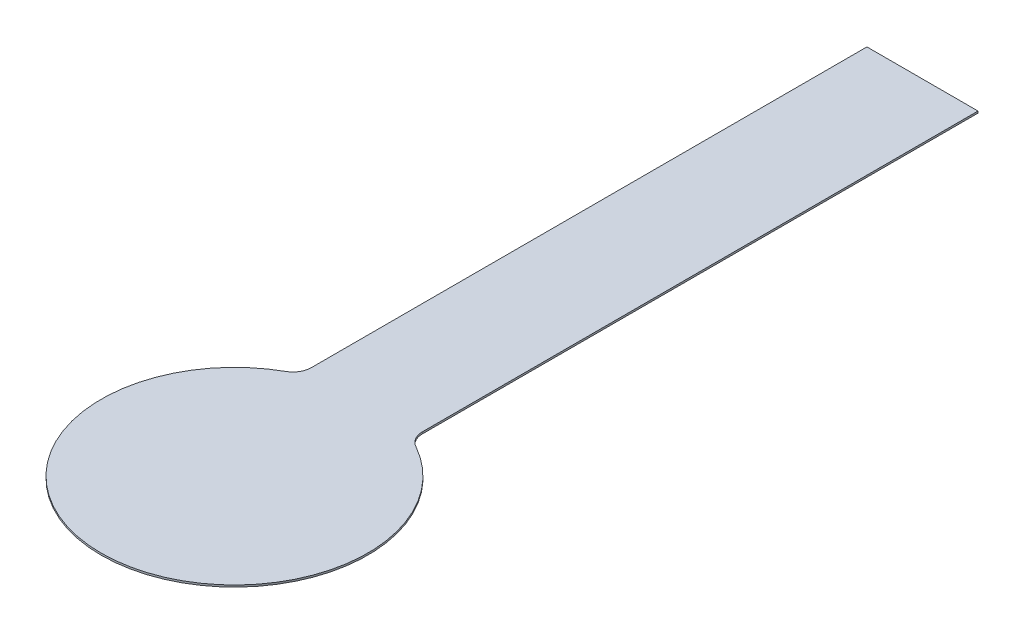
ISO-10303-21;
HEADER;
FILE_DESCRIPTION(('STEP AP214'),'2;1');
FILE_NAME('part.step','',(''),(''),'','','');
FILE_SCHEMA(('AUTOMOTIVE_DESIGN { 1 0 10303 214 1 1 1 1 }'));
ENDSEC;
DATA;
#1=APPLICATION_CONTEXT('core data for automotive mechanical design processes');
#2=APPLICATION_PROTOCOL_DEFINITION('international standard','automotive_design',2000,#1);
#3=PRODUCT_CONTEXT('',#1,'mechanical');
#4=PRODUCT('Part','Part','',(#3));
#5=PRODUCT_RELATED_PRODUCT_CATEGORY('part','',(#4));
#6=PRODUCT_DEFINITION_FORMATION('','',#4);
#7=PRODUCT_DEFINITION_CONTEXT('part definition',#1,'design');
#8=PRODUCT_DEFINITION('design','',#6,#7);
#9=PRODUCT_DEFINITION_SHAPE('','',#8);
#10=(LENGTH_UNIT() NAMED_UNIT(*) SI_UNIT(.MILLI.,.METRE.));
#11=(NAMED_UNIT(*) PLANE_ANGLE_UNIT() SI_UNIT($,.RADIAN.));
#12=(NAMED_UNIT(*) SI_UNIT($,.STERADIAN.) SOLID_ANGLE_UNIT());
#13=UNCERTAINTY_MEASURE_WITH_UNIT(LENGTH_MEASURE(1.E-05),#10,'distance_accuracy_value','');
#14=(GEOMETRIC_REPRESENTATION_CONTEXT(3) GLOBAL_UNCERTAINTY_ASSIGNED_CONTEXT((#13)) GLOBAL_UNIT_ASSIGNED_CONTEXT((#10,
#11,#12)) REPRESENTATION_CONTEXT('',''));
#15=CARTESIAN_POINT('',(0.,0.,0.));
#16=DIRECTION('',(0.,0.,1.));
#17=DIRECTION('',(1.,0.,0.));
#18=AXIS2_PLACEMENT_3D('',#15,#16,#17);
#19=CARTESIAN_POINT('',(-3.80969239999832,0.127,-9.09110120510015));
#20=DIRECTION('',(1.,0.,0.));
#21=DIRECTION('',(0.,0.,-1.));
#22=AXIS2_PLACEMENT_3D('',#19,#20,#21);
#23=PLANE('',#22);
#24=DIRECTION('',(0.,0.,1.));
#25=VECTOR('',#24,1.);
#26=CARTESIAN_POINT('',(-3.80969239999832,0.,-9.09110120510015));
#27=LINE('',#26,#25);
#28=CARTESIAN_POINT('',(-3.80969239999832,0.,-47.1911012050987));
#29=VERTEX_POINT('',#28);
#30=CARTESIAN_POINT('',(-3.80969239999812,0.,-9.09110120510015));
#31=VERTEX_POINT('',#30);
#32=EDGE_CURVE('E114',#29,#31,#27,.T.);
#33=ORIENTED_EDGE('',*,*,#32,.T.);
#34=DIRECTION('',(0.,-1.,0.));
#35=VECTOR('',#34,1.);
#36=CARTESIAN_POINT('',(-3.80969239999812,0.127,-9.09110120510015));
#37=LINE('',#36,#35);
#38=CARTESIAN_POINT('',(-3.80969239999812,0.127,-9.09110120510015));
#39=VERTEX_POINT('',#38);
#40=EDGE_CURVE('E11',#39,#31,#37,.T.);
#41=ORIENTED_EDGE('',*,*,#40,.F.);
#42=DIRECTION('',(0.,0.,1.));
#43=VECTOR('',#42,1.);
#44=CARTESIAN_POINT('',(-3.80969239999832,0.127,-9.09110120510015));
#45=LINE('',#44,#43);
#46=CARTESIAN_POINT('',(-3.80969239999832,0.127,-47.1911012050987));
#47=VERTEX_POINT('',#46);
#48=EDGE_CURVE('E124',#47,#39,#45,.T.);
#49=ORIENTED_EDGE('',*,*,#48,.F.);
#50=DIRECTION('',(0.,-1.,0.));
#51=VECTOR('',#50,1.);
#52=CARTESIAN_POINT('',(-3.80969239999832,0.127,-47.1911012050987));
#53=LINE('',#52,#51);
#54=EDGE_CURVE('E110',#47,#29,#53,.T.);
#55=ORIENTED_EDGE('',*,*,#54,.T.);
#56=EDGE_LOOP('',(#33,#41,#49,#55));
#57=FACE_BOUND('',#56,.T.);
#58=ADVANCED_FACE('F30',(#57),#23,.F.);
#59=CARTESIAN_POINT('',(-5.07969239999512,0.127,-9.09110120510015));
#60=DIRECTION('',(0.,-1.,0.));
#61=DIRECTION('',(0.,0.,-1.));
#62=AXIS2_PLACEMENT_3D('',#59,#60,#61);
#63=CYLINDRICAL_SURFACE('',#62,1.26999999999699);
#64=CARTESIAN_POINT('',(-5.07969239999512,0.,-9.09110120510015));
#65=DIRECTION('',(0.,-1.,0.));
#66=DIRECTION('',(0.,0.,1.));
#67=AXIS2_PLACEMENT_3D('',#64,#65,#66);
#68=CIRCLE('',#67,1.26999999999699);
#69=CARTESIAN_POINT('',(-4.46021771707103,0.,-7.98243032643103));
#70=VERTEX_POINT('',#69);
#71=EDGE_CURVE('E117',#31,#70,#68,.T.);
#72=ORIENTED_EDGE('',*,*,#71,.T.);
#73=DIRECTION('',(0.,-1.,0.));
#74=VECTOR('',#73,1.);
#75=CARTESIAN_POINT('',(-4.46021771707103,0.127,-7.98243032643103));
#76=LINE('',#75,#74);
#77=CARTESIAN_POINT('',(-4.46021771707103,0.127,-7.98243032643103));
#78=VERTEX_POINT('',#77);
#79=EDGE_CURVE('E38',#78,#70,#76,.T.);
#80=ORIENTED_EDGE('',*,*,#79,.F.);
#81=CARTESIAN_POINT('',(-5.07969239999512,0.127,-9.09110120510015));
#82=DIRECTION('',(0.,-1.,0.));
#83=DIRECTION('',(0.,0.,1.));
#84=AXIS2_PLACEMENT_3D('',#81,#82,#83);
#85=CIRCLE('',#84,1.26999999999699);
#86=EDGE_CURVE('E83',#39,#78,#85,.T.);
#87=ORIENTED_EDGE('',*,*,#86,.F.);
#88=ORIENTED_EDGE('',*,*,#40,.T.);
#89=EDGE_LOOP('',(#72,#80,#87,#88));
#90=FACE_BOUND('',#89,.T.);
#91=ADVANCED_FACE('F148',(#90),#63,.F.);
#92=CARTESIAN_POINT('',(0.,0.127,0.));
#93=DIRECTION('',(0.,-1.,0.));
#94=DIRECTION('',(0.,0.,-1.));
#95=AXIS2_PLACEMENT_3D('',#92,#93,#94);
#96=CYLINDRICAL_SURFACE('',#95,9.14400000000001);
#97=CARTESIAN_POINT('',(0.,0.,0.));
#98=DIRECTION('',(0.,1.,0.));
#99=DIRECTION('',(0.,0.,1.));
#100=AXIS2_PLACEMENT_3D('',#97,#98,#99);
#101=CIRCLE('',#100,9.14400000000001);
#102=CARTESIAN_POINT('',(4.46021771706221,0.,-7.98243032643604));
#103=VERTEX_POINT('',#102);
#104=EDGE_CURVE('E119',#70,#103,#101,.T.);
#105=ORIENTED_EDGE('',*,*,#104,.T.);
#106=DIRECTION('',(0.,-1.,0.));
#107=VECTOR('',#106,1.);
#108=CARTESIAN_POINT('',(4.46021771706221,0.127,-7.98243032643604));
#109=LINE('',#108,#107);
#110=CARTESIAN_POINT('',(4.46021771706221,0.127,-7.98243032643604));
#111=VERTEX_POINT('',#110);
#112=EDGE_CURVE('E105',#111,#103,#109,.T.);
#113=ORIENTED_EDGE('',*,*,#112,.F.);
#114=CARTESIAN_POINT('',(0.,0.127,0.));
#115=DIRECTION('',(0.,1.,0.));
#116=DIRECTION('',(0.,0.,1.));
#117=AXIS2_PLACEMENT_3D('',#114,#115,#116);
#118=CIRCLE('',#117,9.14400000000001);
#119=EDGE_CURVE('E96',#78,#111,#118,.T.);
#120=ORIENTED_EDGE('',*,*,#119,.F.);
#121=ORIENTED_EDGE('',*,*,#79,.T.);
#122=EDGE_LOOP('',(#105,#113,#120,#121));
#123=FACE_BOUND('',#122,.T.);
#124=ADVANCED_FACE('F130',(#123),#96,.T.);
#125=CARTESIAN_POINT('',(5.07969239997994,0.127,-9.09110120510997));
#126=DIRECTION('',(0.,-1.,0.));
#127=DIRECTION('',(0.,0.,-1.));
#128=AXIS2_PLACEMENT_3D('',#125,#126,#127);
#129=CYLINDRICAL_SURFACE('',#128,1.26999999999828);
#130=CARTESIAN_POINT('',(5.07969239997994,0.,-9.09110120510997));
#131=DIRECTION('',(0.,-1.,0.));
#132=DIRECTION('',(0.,0.,1.));
#133=AXIS2_PLACEMENT_3D('',#130,#131,#132);
#134=CIRCLE('',#133,1.26999999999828);
#135=CARTESIAN_POINT('',(3.80969239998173,0.,-9.09110120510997));
#136=VERTEX_POINT('',#135);
#137=EDGE_CURVE('E104',#103,#136,#134,.T.);
#138=ORIENTED_EDGE('',*,*,#137,.T.);
#139=DIRECTION('',(0.,-1.,0.));
#140=VECTOR('',#139,1.);
#141=CARTESIAN_POINT('',(3.80969239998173,0.127,-9.09110120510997));
#142=LINE('',#141,#140);
#143=CARTESIAN_POINT('',(3.80969239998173,0.127,-9.09110120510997));
#144=VERTEX_POINT('',#143);
#145=EDGE_CURVE('E101',#144,#136,#142,.T.);
#146=ORIENTED_EDGE('',*,*,#145,.F.);
#147=CARTESIAN_POINT('',(5.07969239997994,0.127,-9.09110120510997));
#148=DIRECTION('',(0.,-1.,0.));
#149=DIRECTION('',(0.,0.,1.));
#150=AXIS2_PLACEMENT_3D('',#147,#148,#149);
#151=CIRCLE('',#150,1.26999999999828);
#152=EDGE_CURVE('E90',#111,#144,#151,.T.);
#153=ORIENTED_EDGE('',*,*,#152,.F.);
#154=ORIENTED_EDGE('',*,*,#112,.T.);
#155=EDGE_LOOP('',(#138,#146,#153,#154));
#156=FACE_BOUND('',#155,.T.);
#157=ADVANCED_FACE('F102',(#156),#129,.F.);
#158=CARTESIAN_POINT('',(3.80969239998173,0.127,-9.09110120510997));
#159=DIRECTION('',(-1.,0.,0.));
#160=DIRECTION('',(0.,0.,1.));
#161=AXIS2_PLACEMENT_3D('',#158,#159,#160);
#162=PLANE('',#161);
#163=DIRECTION('',(0.,0.,-1.));
#164=VECTOR('',#163,1.);
#165=CARTESIAN_POINT('',(3.80969239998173,0.,-9.09110120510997));
#166=LINE('',#165,#164);
#167=CARTESIAN_POINT('',(3.80969239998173,0.,-47.1911012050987));
#168=VERTEX_POINT('',#167);
#169=EDGE_CURVE('E69',#136,#168,#166,.T.);
#170=ORIENTED_EDGE('',*,*,#169,.T.);
#171=DIRECTION('',(0.,-1.,0.));
#172=VECTOR('',#171,1.);
#173=CARTESIAN_POINT('',(3.80969239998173,0.127,-47.1911012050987));
#174=LINE('',#173,#172);
#175=CARTESIAN_POINT('',(3.80969239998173,0.127,-47.1911012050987));
#176=VERTEX_POINT('',#175);
#177=EDGE_CURVE('E106',#176,#168,#174,.T.);
#178=ORIENTED_EDGE('',*,*,#177,.F.);
#179=DIRECTION('',(0.,0.,-1.));
#180=VECTOR('',#179,1.);
#181=CARTESIAN_POINT('',(3.80969239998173,0.127,-9.09110120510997));
#182=LINE('',#181,#180);
#183=EDGE_CURVE('E94',#144,#176,#182,.T.);
#184=ORIENTED_EDGE('',*,*,#183,.F.);
#185=ORIENTED_EDGE('',*,*,#145,.T.);
#186=EDGE_LOOP('',(#170,#178,#184,#185));
#187=FACE_BOUND('',#186,.T.);
#188=ADVANCED_FACE('F108',(#187),#162,.F.);
#189=CARTESIAN_POINT('',(-3.80969239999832,0.127,-47.1911012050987));
#190=DIRECTION('',(0.,0.,1.));
#191=DIRECTION('',(1.,0.,0.));
#192=AXIS2_PLACEMENT_3D('',#189,#190,#191);
#193=PLANE('',#192);
#194=DIRECTION('',(-1.,0.,0.));
#195=VECTOR('',#194,1.);
#196=CARTESIAN_POINT('',(-3.80969239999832,0.,-47.1911012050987));
#197=LINE('',#196,#195);
#198=EDGE_CURVE('E75',#168,#29,#197,.T.);
#199=ORIENTED_EDGE('',*,*,#198,.T.);
#200=ORIENTED_EDGE('',*,*,#54,.F.);
#201=DIRECTION('',(-1.,0.,0.));
#202=VECTOR('',#201,1.);
#203=CARTESIAN_POINT('',(-3.80969239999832,0.127,-47.1911012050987));
#204=LINE('',#203,#202);
#205=EDGE_CURVE('E46',#176,#47,#204,.T.);
#206=ORIENTED_EDGE('',*,*,#205,.F.);
#207=ORIENTED_EDGE('',*,*,#177,.T.);
#208=EDGE_LOOP('',(#199,#200,#206,#207));
#209=FACE_BOUND('',#208,.T.);
#210=ADVANCED_FACE('F137',(#209),#193,.F.);
#211=CARTESIAN_POINT('',(5.07969239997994,0.127,-9.09110120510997));
#212=DIRECTION('',(0.,1.,0.));
#213=DIRECTION('',(0.,0.,1.));
#214=AXIS2_PLACEMENT_3D('',#211,#212,#213);
#215=PLANE('',#214);
#216=ORIENTED_EDGE('',*,*,#48,.T.);
#217=ORIENTED_EDGE('',*,*,#86,.T.);
#218=ORIENTED_EDGE('',*,*,#119,.T.);
#219=ORIENTED_EDGE('',*,*,#152,.T.);
#220=ORIENTED_EDGE('',*,*,#183,.T.);
#221=ORIENTED_EDGE('',*,*,#205,.T.);
#222=EDGE_LOOP('',(#216,#217,#218,#219,#220,#221));
#223=FACE_BOUND('',#222,.T.);
#224=ADVANCED_FACE('F92',(#223),#215,.T.);
#225=CARTESIAN_POINT('',(5.07969239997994,0.,-9.09110120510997));
#226=DIRECTION('',(0.,1.,0.));
#227=DIRECTION('',(0.,0.,1.));
#228=AXIS2_PLACEMENT_3D('',#225,#226,#227);
#229=PLANE('',#228);
#230=ORIENTED_EDGE('',*,*,#32,.F.);
#231=ORIENTED_EDGE('',*,*,#198,.F.);
#232=ORIENTED_EDGE('',*,*,#169,.F.);
#233=ORIENTED_EDGE('',*,*,#137,.F.);
#234=ORIENTED_EDGE('',*,*,#104,.F.);
#235=ORIENTED_EDGE('',*,*,#71,.F.);
#236=EDGE_LOOP('',(#230,#231,#232,#233,#234,#235));
#237=FACE_BOUND('',#236,.T.);
#238=ADVANCED_FACE('F133',(#237),#229,.F.);
#239=CLOSED_SHELL('',(#58,#91,#124,#157,#188,#210,#224,#238));
#240=MANIFOLD_SOLID_BREP('B2',#239);
#241=ADVANCED_BREP_SHAPE_REPRESENTATION('',(#18,#240),#14);
#242=SHAPE_DEFINITION_REPRESENTATION(#9,#241);
ENDSEC;
END-ISO-10303-21;
